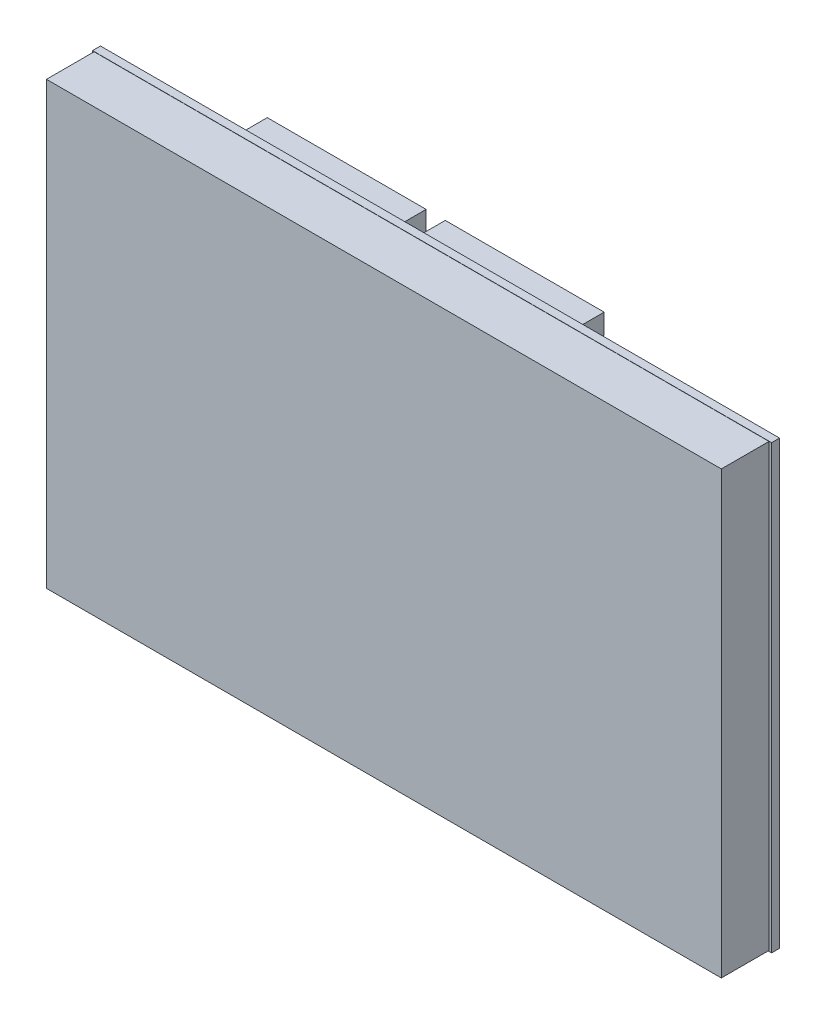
from build123d import *

# Parameters (mm, degrees)
SKIZZE1_W                         = 85.49
SKIZZE1_H                         = 55.63
AUFSATZ_LINEAR_AUSTRAGEN1_DEPTH   = 1
SKIZZE2_W                         = 20
SKIZZE2_H                         = 2.5
AUFSATZ_LINEAR_AUSTRAGEN2_DEPTH   = 5
AUFSATZ_LINEAR_AUSTRAGEN2_2_DEPTH = 5
SKIZZE3_W                         = 15
SKIZZE3_H                         = 15
AUFSATZ_LINEAR_AUSTRAGEN3_DEPTH   = 5
SKIZZE4_W                         = 16
SKIZZE4_H                         = 2.5
AUFSATZ_LINEAR_AUSTRAGEN4_DEPTH   = 5
AUFSATZ_LINEAR_AUSTRAGEN4_2_DEPTH = 5
SKIZZE5_W                         = 16
SKIZZE5_H                         = 8
AUFSATZ_LINEAR_AUSTRAGEN5_DEPTH   = 2
SKIZZE5_W_2                       = 5
SKIZZE5_H_2                       = 2
AUFSATZ_LINEAR_AUSTRAGEN5_2_DEPTH = 2
SKIZZE5_H_3                       = 5
AUFSATZ_LINEAR_AUSTRAGEN5_3_DEPTH = 2
SKIZZE6_W                         = 84.96
SKIZZE6_H                         = 55.5
AUFSATZ_LINEAR_AUSTRAGEN6_DEPTH   = 6


with BuildPart() as part:
    # Skizze1 → Aufsatz-Linear austragen1 (new body)
    with BuildSketch(Plane.XY):
        Rectangle(SKIZZE1_W, SKIZZE1_H)
    extrude(amount=-AUFSATZ_LINEAR_AUSTRAGEN1_DEPTH)


with BuildPart() as body_2:
    # Skizze2 → Aufsatz-Linear austragen2 (new body)
    with BuildSketch(Plane(origin=(0, 0, -1), x_dir=(-1, 0, 0), z_dir=(0, 0, -1))):
        with Locations((16.745, 24.255)):
            Rectangle(SKIZZE2_W, SKIZZE2_H)
    extrude(amount=AUFSATZ_LINEAR_AUSTRAGEN2_DEPTH)


with BuildPart() as body_3:
    # Skizze2 → Aufsatz-Linear austragen2 2 (new body)
    with BuildSketch(Plane(origin=(0, 0, -1), x_dir=(-1, 0, 0), z_dir=(0, 0, -1))):
        with Locations((-5.665, 24.255)):
            Rectangle(SKIZZE2_W, SKIZZE2_H)
    extrude(amount=AUFSATZ_LINEAR_AUSTRAGEN2_2_DEPTH)


with BuildPart() as body_4:
    # Skizze3 → Aufsatz-Linear austragen3 (new body)
    with BuildSketch(Plane(origin=(0, 0, -1), x_dir=(-1, 0, 0), z_dir=(0, 0, -1))):
        with Locations((34.245, -8.315)):
            Rectangle(SKIZZE3_W, SKIZZE3_H)
    extrude(amount=AUFSATZ_LINEAR_AUSTRAGEN3_DEPTH)


with BuildPart() as body_5:
    # Skizze4 → Aufsatz-Linear austragen4 (new body)
    with BuildSketch(Plane(origin=(0, 0, -1), x_dir=(-1, 0, 0), z_dir=(0, 0, -1))):
        with Locations((9.745, -24.065)):
            Rectangle(SKIZZE4_W, SKIZZE4_H)
    extrude(amount=AUFSATZ_LINEAR_AUSTRAGEN4_DEPTH)


with BuildPart() as body_6:
    # Skizze4 → Aufsatz-Linear austragen4 2 (new body)
    with BuildSketch(Plane(origin=(0, 0, -1), x_dir=(-1, 0, 0), z_dir=(0, 0, -1))):
        with Locations((-7.755, -24.065)):
            Rectangle(SKIZZE4_W, SKIZZE4_H)
    extrude(amount=AUFSATZ_LINEAR_AUSTRAGEN4_2_DEPTH)


with BuildPart() as body_7:
    # Skizze5 → Aufsatz-Linear austragen5 (new body)
    with BuildSketch(Plane(origin=(0, 0, -1), x_dir=(-1, 0, 0), z_dir=(0, 0, -1))):
        with Locations((-19.745, 1.185)):
            Rectangle(SKIZZE5_W, SKIZZE5_H)
    extrude(amount=AUFSATZ_LINEAR_AUSTRAGEN5_DEPTH)


with BuildPart() as body_8:
    # Skizze5 → Aufsatz-Linear austragen5 2 (new body)
    with BuildSketch(Plane(origin=(0, 0, -1), x_dir=(-1, 0, 0), z_dir=(0, 0, -1))):
        with Locations((-10.245, -6.815)):
            Rectangle(SKIZZE5_W_2, SKIZZE5_H_2)
    extrude(amount=AUFSATZ_LINEAR_AUSTRAGEN5_2_DEPTH)


with BuildPart() as body_9:
    # Skizze5 → Aufsatz-Linear austragen5 3 (new body)
    with BuildSketch(Plane(origin=(0, 0, -1), x_dir=(-1, 0, 0), z_dir=(0, 0, -1))):
        with Locations((15.245, -13.315)):
            Rectangle(SKIZZE5_W_2, SKIZZE5_H_3)
    extrude(amount=AUFSATZ_LINEAR_AUSTRAGEN5_3_DEPTH)


with BuildPart() as body_10:
    # Skizze6 → Aufsatz-Linear austragen6 (new body)
    with BuildSketch(Plane.XY):
        with Locations((-0.065, 0.035)):
            Rectangle(SKIZZE6_W, SKIZZE6_H)
    extrude(amount=AUFSATZ_LINEAR_AUSTRAGEN6_DEPTH)


solid = Compound([part.part, body_2.part, body_3.part, body_4.part, body_5.part, body_6.part, body_7.part, body_8.part, body_9.part, body_10.part])
